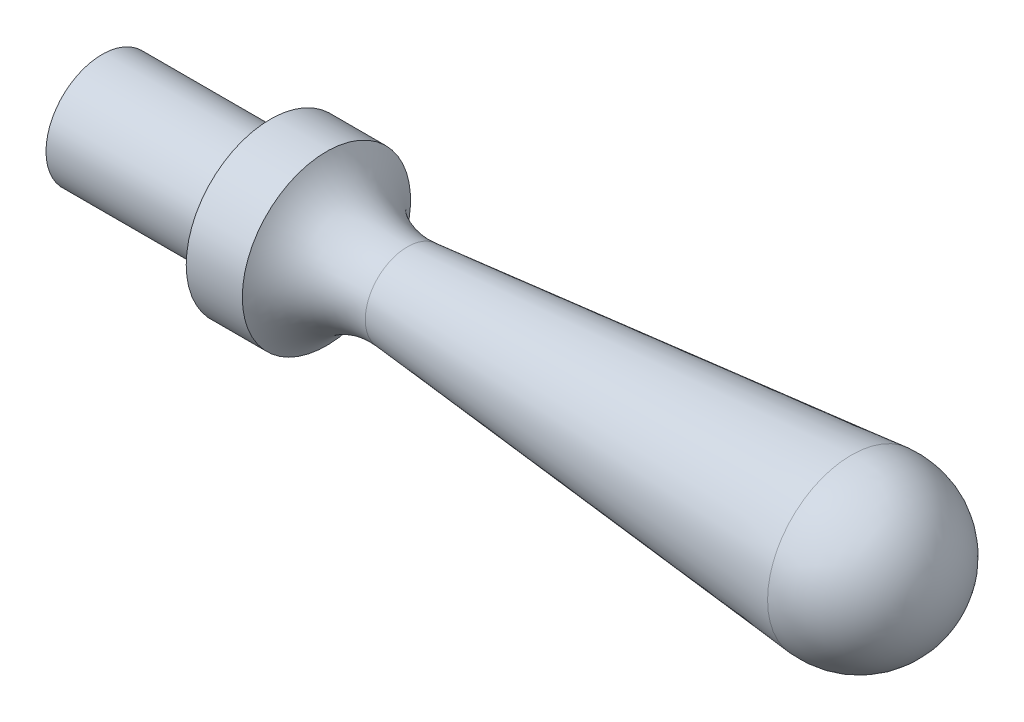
from build123d import *


with BuildPart() as part:
    # Sketch1 → Revolve1 (revolve)
    with BuildSketch(Plane.XY, mode=Mode.PRIVATE) as revolve1_sk:
        with BuildLine():
            Line((0, 0), (0, 2))
            Line((0, 2), (6, 2))
            Line((6, 2), (6, 3))
            Line((6, 3), (8, 3))
            ThreePointArc((8, 3), (9.222122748, 1.824916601), (10.886104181, 1.5))
            Line((10.886104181, 1.5), (26.719514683, 2.986859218))
            ThreePointArc((26.719514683, 2.986859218), (29.019720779, 2.218271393), (30, 0))
            Line((30, 0), (0, 0))
        make_face()
    revolve(revolve1_sk.sketch.rotate(Axis((0, 0, 0), (1, 0, 0)), 90), axis=Axis((0, 0, 0), (1, 0, 0)))


solid = part.part
